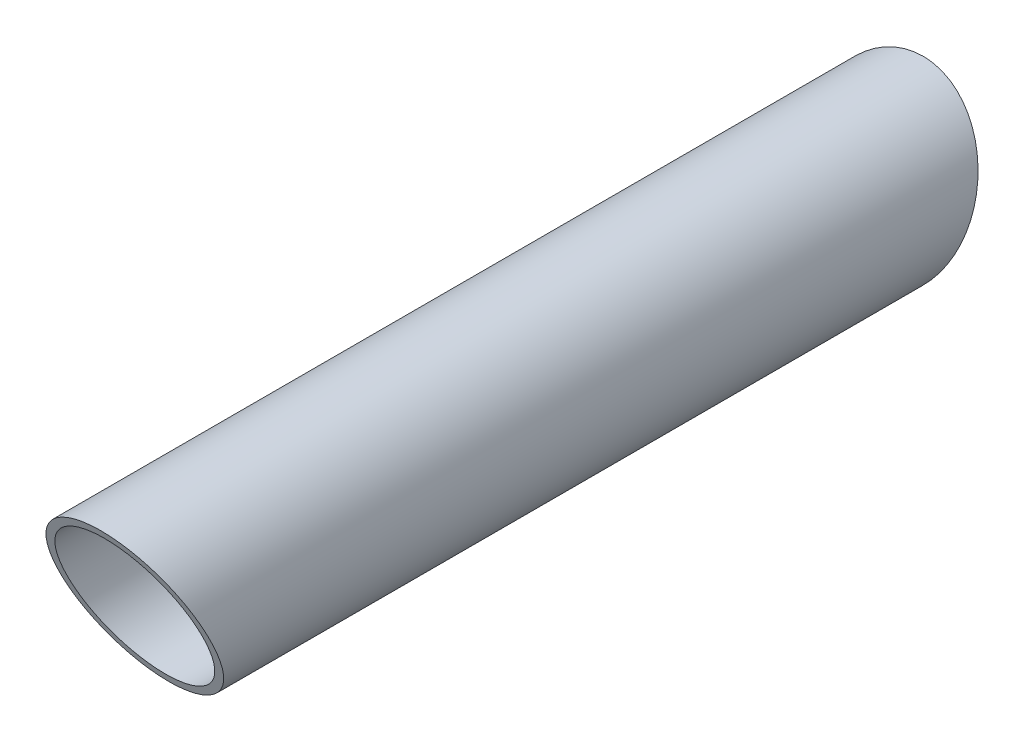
ISO-10303-21;
HEADER;
FILE_DESCRIPTION(('STEP AP214'),'2;1');
FILE_NAME('part.step','',(''),(''),'','','');
FILE_SCHEMA(('AUTOMOTIVE_DESIGN { 1 0 10303 214 1 1 1 1 }'));
ENDSEC;
DATA;
#1=APPLICATION_CONTEXT('core data for automotive mechanical design processes');
#2=APPLICATION_PROTOCOL_DEFINITION('international standard','automotive_design',2000,#1);
#3=PRODUCT_CONTEXT('',#1,'mechanical');
#4=PRODUCT('Part','Part','',(#3));
#5=PRODUCT_RELATED_PRODUCT_CATEGORY('part','',(#4));
#6=PRODUCT_DEFINITION_FORMATION('','',#4);
#7=PRODUCT_DEFINITION_CONTEXT('part definition',#1,'design');
#8=PRODUCT_DEFINITION('design','',#6,#7);
#9=PRODUCT_DEFINITION_SHAPE('','',#8);
#10=(LENGTH_UNIT() NAMED_UNIT(*) SI_UNIT(.MILLI.,.METRE.));
#11=(NAMED_UNIT(*) PLANE_ANGLE_UNIT() SI_UNIT($,.RADIAN.));
#12=(NAMED_UNIT(*) SI_UNIT($,.STERADIAN.) SOLID_ANGLE_UNIT());
#13=UNCERTAINTY_MEASURE_WITH_UNIT(LENGTH_MEASURE(1.E-05),#10,'distance_accuracy_value','');
#14=(GEOMETRIC_REPRESENTATION_CONTEXT(3) GLOBAL_UNCERTAINTY_ASSIGNED_CONTEXT((#13)) GLOBAL_UNIT_ASSIGNED_CONTEXT((#10,
#11,#12)) REPRESENTATION_CONTEXT('',''));
#15=CARTESIAN_POINT('',(0.,0.,0.));
#16=DIRECTION('',(0.,0.,1.));
#17=DIRECTION('',(1.,0.,0.));
#18=AXIS2_PLACEMENT_3D('',#15,#16,#17);
#19=CARTESIAN_POINT('',(0.,0.,100.));
#20=DIRECTION('',(0.,0.,-1.));
#21=DIRECTION('',(-1.,0.,0.));
#22=AXIS2_PLACEMENT_3D('',#19,#20,#21);
#23=CYLINDRICAL_SURFACE('',#22,20.);
#24=CARTESIAN_POINT('',(0.,0.,-91.7565948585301));
#25=DIRECTION('',(0.,0.381070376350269,0.924546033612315));
#26=DIRECTION('',(0.,0.924546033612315,-0.381070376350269));
#27=AXIS2_PLACEMENT_3D('',#24,#25,#26);
#28=ELLIPSE('',#27,21.632238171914,20.);
#29=CARTESIAN_POINT('',(0.,20.,-100.));
#30=VERTEX_POINT('',#29);
#31=EDGE_CURVE('E42',#30,#30,#28,.T.);
#32=ORIENTED_EDGE('',*,*,#31,.T.);
#33=EDGE_LOOP('',(#32));
#34=FACE_BOUND('',#33,.T.);
#35=CARTESIAN_POINT('',(0.,0.,91.7565948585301));
#36=DIRECTION('',(0.,0.381070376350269,-0.924546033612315));
#37=DIRECTION('',(0.,-0.924546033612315,-0.381070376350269));
#38=AXIS2_PLACEMENT_3D('',#35,#36,#37);
#39=ELLIPSE('',#38,21.632238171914,20.);
#40=CARTESIAN_POINT('',(0.,-20.,83.5131897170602));
#41=VERTEX_POINT('',#40);
#42=EDGE_CURVE('E10',#41,#41,#39,.T.);
#43=ORIENTED_EDGE('',*,*,#42,.T.);
#44=EDGE_LOOP('',(#43));
#45=FACE_BOUND('',#44,.T.);
#46=ADVANCED_FACE('F30',(#34,#45),#23,.T.);
#47=CARTESIAN_POINT('',(0.,0.,100.));
#48=DIRECTION('',(0.,0.,-1.));
#49=DIRECTION('',(-1.,0.,0.));
#50=AXIS2_PLACEMENT_3D('',#47,#48,#49);
#51=CYLINDRICAL_SURFACE('',#50,18.);
#52=CARTESIAN_POINT('',(0.,0.,-91.7565948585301));
#53=DIRECTION('',(0.,0.381070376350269,0.924546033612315));
#54=DIRECTION('',(0.,0.924546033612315,-0.381070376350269));
#55=AXIS2_PLACEMENT_3D('',#52,#53,#54);
#56=ELLIPSE('',#55,19.4690143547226,18.);
#57=CARTESIAN_POINT('',(0.,18.,-99.175659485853));
#58=VERTEX_POINT('',#57);
#59=EDGE_CURVE('E33',#58,#58,#56,.T.);
#60=ORIENTED_EDGE('',*,*,#59,.F.);
#61=EDGE_LOOP('',(#60));
#62=FACE_BOUND('',#61,.T.);
#63=CARTESIAN_POINT('',(0.,0.,91.7565948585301));
#64=DIRECTION('',(0.,0.381070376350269,-0.924546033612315));
#65=DIRECTION('',(0.,-0.924546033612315,-0.381070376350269));
#66=AXIS2_PLACEMENT_3D('',#63,#64,#65);
#67=ELLIPSE('',#66,19.4690143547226,18.);
#68=CARTESIAN_POINT('',(0.,-18.,84.3375302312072));
#69=VERTEX_POINT('',#68);
#70=EDGE_CURVE('E37',#69,#69,#67,.T.);
#71=ORIENTED_EDGE('',*,*,#70,.F.);
#72=EDGE_LOOP('',(#71));
#73=FACE_BOUND('',#72,.T.);
#74=ADVANCED_FACE('F53',(#62,#73),#51,.F.);
#75=CARTESIAN_POINT('',(-20.,-20.,83.5131897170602));
#76=DIRECTION('',(0.,0.381070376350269,-0.924546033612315));
#77=DIRECTION('',(0.,0.924546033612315,0.381070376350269));
#78=AXIS2_PLACEMENT_3D('',#75,#76,#77);
#79=PLANE('',#78);
#80=ORIENTED_EDGE('',*,*,#70,.T.);
#81=EDGE_LOOP('',(#80));
#82=FACE_BOUND('',#81,.T.);
#83=ORIENTED_EDGE('',*,*,#42,.F.);
#84=EDGE_LOOP('',(#83));
#85=FACE_BOUND('',#84,.T.);
#86=ADVANCED_FACE('F56',(#82,#85),#79,.F.);
#87=CARTESIAN_POINT('',(-20.,-20.,-83.5131897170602));
#88=DIRECTION('',(0.,0.381070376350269,0.924546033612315));
#89=DIRECTION('',(0.,-0.924546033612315,0.381070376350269));
#90=AXIS2_PLACEMENT_3D('',#87,#88,#89);
#91=PLANE('',#90);
#92=ORIENTED_EDGE('',*,*,#59,.T.);
#93=EDGE_LOOP('',(#92));
#94=FACE_BOUND('',#93,.T.);
#95=ORIENTED_EDGE('',*,*,#31,.F.);
#96=EDGE_LOOP('',(#95));
#97=FACE_BOUND('',#96,.T.);
#98=ADVANCED_FACE('F50',(#94,#97),#91,.F.);
#99=CLOSED_SHELL('',(#46,#74,#86,#98));
#100=MANIFOLD_SOLID_BREP('B2',#99);
#101=ADVANCED_BREP_SHAPE_REPRESENTATION('',(#18,#100),#14);
#102=SHAPE_DEFINITION_REPRESENTATION(#9,#101);
ENDSEC;
END-ISO-10303-21;
